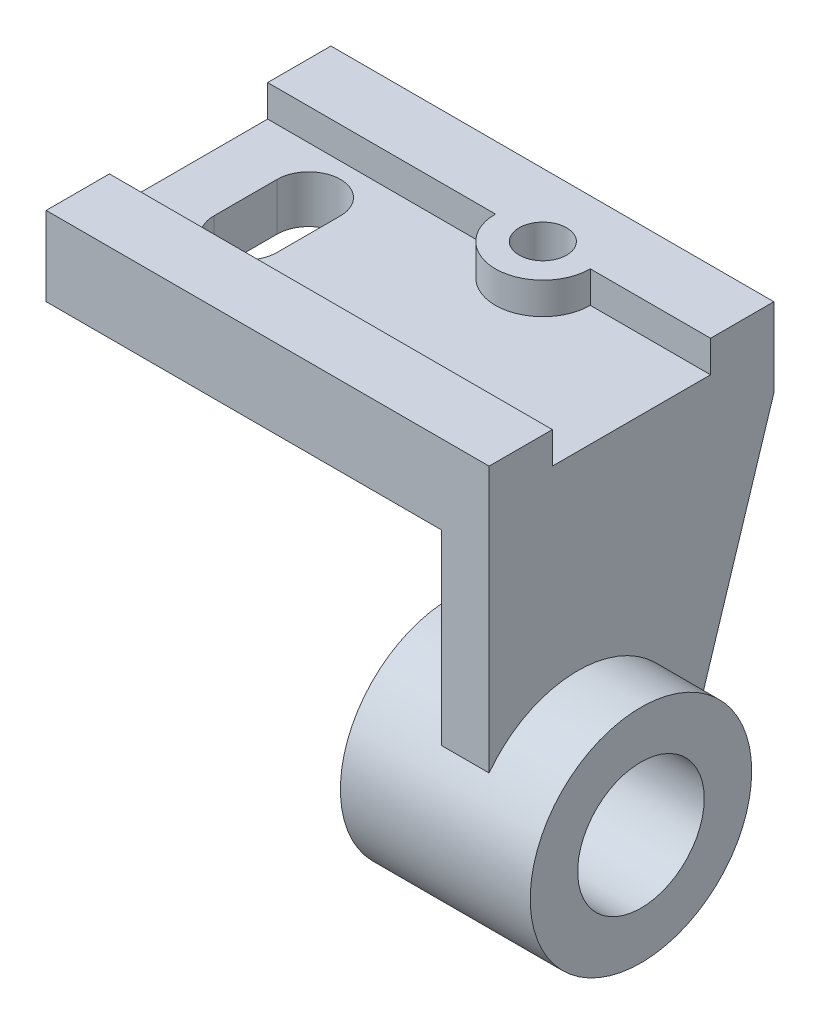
ISO-10303-21;
HEADER;
FILE_DESCRIPTION(('STEP AP214'),'2;1');
FILE_NAME('part.step','',(''),(''),'','','');
FILE_SCHEMA(('AUTOMOTIVE_DESIGN { 1 0 10303 214 1 1 1 1 }'));
ENDSEC;
DATA;
#1=APPLICATION_CONTEXT('core data for automotive mechanical design processes');
#2=APPLICATION_PROTOCOL_DEFINITION('international standard','automotive_design',2000,#1);
#3=PRODUCT_CONTEXT('',#1,'mechanical');
#4=PRODUCT('Part','Part','',(#3));
#5=PRODUCT_RELATED_PRODUCT_CATEGORY('part','',(#4));
#6=PRODUCT_DEFINITION_FORMATION('','',#4);
#7=PRODUCT_DEFINITION_CONTEXT('part definition',#1,'design');
#8=PRODUCT_DEFINITION('design','',#6,#7);
#9=PRODUCT_DEFINITION_SHAPE('','',#8);
#10=(LENGTH_UNIT() NAMED_UNIT(*) SI_UNIT(.MILLI.,.METRE.));
#11=(NAMED_UNIT(*) PLANE_ANGLE_UNIT() SI_UNIT($,.RADIAN.));
#12=(NAMED_UNIT(*) SI_UNIT($,.STERADIAN.) SOLID_ANGLE_UNIT());
#13=UNCERTAINTY_MEASURE_WITH_UNIT(LENGTH_MEASURE(1.E-05),#10,'distance_accuracy_value','');
#14=(GEOMETRIC_REPRESENTATION_CONTEXT(3) GLOBAL_UNCERTAINTY_ASSIGNED_CONTEXT((#13)) GLOBAL_UNIT_ASSIGNED_CONTEXT((#10,
#11,#12)) REPRESENTATION_CONTEXT('',''));
#15=CARTESIAN_POINT('',(0.,0.,0.));
#16=DIRECTION('',(0.,0.,1.));
#17=DIRECTION('',(1.,0.,0.));
#18=AXIS2_PLACEMENT_3D('',#15,#16,#17);
#19=CARTESIAN_POINT('',(0.,0.,0.));
#20=DIRECTION('',(0.,-1.,0.));
#21=DIRECTION('',(0.,0.,-1.));
#22=AXIS2_PLACEMENT_3D('',#19,#20,#21);
#23=PLANE('',#22);
#24=CARTESIAN_POINT('',(-53.,0.,20.));
#25=DIRECTION('',(0.,1.,0.));
#26=DIRECTION('',(0.,0.,1.));
#27=AXIS2_PLACEMENT_3D('',#24,#25,#26);
#28=CIRCLE('',#27,7.5);
#29=CARTESIAN_POINT('',(-53.,0.,27.5));
#30=VERTEX_POINT('',#29);
#31=EDGE_CURVE('E210',#30,#30,#28,.T.);
#32=ORIENTED_EDGE('',*,*,#31,.T.);
#33=EDGE_LOOP('',(#32));
#34=FACE_BOUND('',#33,.T.);
#35=CARTESIAN_POINT('',(-112.,0.,35.));
#36=DIRECTION('',(0.,1.,0.));
#37=DIRECTION('',(0.,0.,1.));
#38=AXIS2_PLACEMENT_3D('',#35,#36,#37);
#39=CIRCLE('',#38,10.);
#40=CARTESIAN_POINT('',(-102.,0.,35.));
#41=VERTEX_POINT('',#40);
#42=CARTESIAN_POINT('',(-122.,0.,35.));
#43=VERTEX_POINT('',#42);
#44=EDGE_CURVE('E180',#41,#43,#39,.T.);
#45=ORIENTED_EDGE('',*,*,#44,.T.);
#46=DIRECTION('',(0.,0.,1.));
#47=VECTOR('',#46,1.);
#48=CARTESIAN_POINT('',(-122.,0.,35.));
#49=LINE('',#48,#47);
#50=CARTESIAN_POINT('',(-122.,0.,55.));
#51=VERTEX_POINT('',#50);
#52=EDGE_CURVE('E183',#43,#51,#49,.T.);
#53=ORIENTED_EDGE('',*,*,#52,.T.);
#54=CARTESIAN_POINT('',(-112.,0.,55.));
#55=DIRECTION('',(0.,1.,0.));
#56=DIRECTION('',(0.,0.,1.));
#57=AXIS2_PLACEMENT_3D('',#54,#55,#56);
#58=CIRCLE('',#57,10.);
#59=CARTESIAN_POINT('',(-102.,0.,55.));
#60=VERTEX_POINT('',#59);
#61=EDGE_CURVE('E56',#51,#60,#58,.T.);
#62=ORIENTED_EDGE('',*,*,#61,.T.);
#63=DIRECTION('',(0.,0.,-1.));
#64=VECTOR('',#63,1.);
#65=CARTESIAN_POINT('',(-102.,0.,55.));
#66=LINE('',#65,#64);
#67=EDGE_CURVE('E188',#60,#41,#66,.T.);
#68=ORIENTED_EDGE('',*,*,#67,.T.);
#69=EDGE_LOOP('',(#45,#53,#62,#68));
#70=FACE_BOUND('',#69,.T.);
#71=DIRECTION('',(-1.,0.,0.));
#72=VECTOR('',#71,1.);
#73=CARTESIAN_POINT('',(0.,0.,0.));
#74=LINE('',#73,#72);
#75=CARTESIAN_POINT('',(-15.,0.,0.));
#76=VERTEX_POINT('',#75);
#77=CARTESIAN_POINT('',(-140.,0.,0.));
#78=VERTEX_POINT('',#77);
#79=EDGE_CURVE('E247',#76,#78,#74,.T.);
#80=ORIENTED_EDGE('',*,*,#79,.F.);
#81=DIRECTION('',(0.,0.,1.));
#82=VECTOR('',#81,1.);
#83=CARTESIAN_POINT('',(-15.,0.,0.));
#84=LINE('',#83,#82);
#85=CARTESIAN_POINT('',(-15.,0.,90.));
#86=VERTEX_POINT('',#85);
#87=EDGE_CURVE('E152',#76,#86,#84,.T.);
#88=ORIENTED_EDGE('',*,*,#87,.T.);
#89=DIRECTION('',(1.,0.,0.));
#90=VECTOR('',#89,1.);
#91=CARTESIAN_POINT('',(0.,0.,90.));
#92=LINE('',#91,#90);
#93=CARTESIAN_POINT('',(-140.,0.,90.));
#94=VERTEX_POINT('',#93);
#95=EDGE_CURVE('E288',#94,#86,#92,.T.);
#96=ORIENTED_EDGE('',*,*,#95,.F.);
#97=DIRECTION('',(0.,0.,1.));
#98=VECTOR('',#97,1.);
#99=CARTESIAN_POINT('',(-140.,0.,0.));
#100=LINE('',#99,#98);
#101=EDGE_CURVE('E273',#78,#94,#100,.T.);
#102=ORIENTED_EDGE('',*,*,#101,.F.);
#103=EDGE_LOOP('',(#80,#88,#96,#102));
#104=FACE_BOUND('',#103,.T.);
#105=ADVANCED_FACE('F31',(#34,#70,#104),#23,.T.);
#106=CARTESIAN_POINT('',(0.,25.,0.));
#107=DIRECTION('',(0.,-1.,0.));
#108=DIRECTION('',(0.,0.,-1.));
#109=AXIS2_PLACEMENT_3D('',#106,#107,#108);
#110=PLANE('',#109);
#111=CARTESIAN_POINT('',(-53.,25.,20.));
#112=DIRECTION('',(0.,1.,0.));
#113=DIRECTION('',(0.,0.,1.));
#114=AXIS2_PLACEMENT_3D('',#111,#112,#113);
#115=CIRCLE('',#114,7.5);
#116=CARTESIAN_POINT('',(-53.,25.,27.5));
#117=VERTEX_POINT('',#116);
#118=EDGE_CURVE('E203',#117,#117,#115,.T.);
#119=ORIENTED_EDGE('',*,*,#118,.F.);
#120=EDGE_LOOP('',(#119));
#121=FACE_BOUND('',#120,.T.);
#122=DIRECTION('',(0.,0.,1.));
#123=VECTOR('',#122,1.);
#124=CARTESIAN_POINT('',(-140.,25.,0.));
#125=LINE('',#124,#123);
#126=CARTESIAN_POINT('',(-140.,25.,0.));
#127=VERTEX_POINT('',#126);
#128=CARTESIAN_POINT('',(-140.,25.,20.));
#129=VERTEX_POINT('',#128);
#130=EDGE_CURVE('E265',#127,#129,#125,.T.);
#131=ORIENTED_EDGE('',*,*,#130,.T.);
#132=DIRECTION('',(-1.,0.,0.));
#133=VECTOR('',#132,1.);
#134=CARTESIAN_POINT('',(-140.,25.,20.));
#135=LINE('',#134,#133);
#136=CARTESIAN_POINT('',(-68.,25.,20.));
#137=VERTEX_POINT('',#136);
#138=EDGE_CURVE('E220',#137,#129,#135,.T.);
#139=ORIENTED_EDGE('',*,*,#138,.F.);
#140=CARTESIAN_POINT('',(-53.,25.,20.));
#141=DIRECTION('',(0.,-1.,0.));
#142=DIRECTION('',(0.,0.,1.));
#143=AXIS2_PLACEMENT_3D('',#140,#141,#142);
#144=CIRCLE('',#143,15.);
#145=CARTESIAN_POINT('',(-38.,25.,20.));
#146=VERTEX_POINT('',#145);
#147=EDGE_CURVE('E240',#146,#137,#144,.T.);
#148=ORIENTED_EDGE('',*,*,#147,.F.);
#149=DIRECTION('',(-1.,0.,0.));
#150=VECTOR('',#149,1.);
#151=CARTESIAN_POINT('',(-38.,25.,20.));
#152=LINE('',#151,#150);
#153=CARTESIAN_POINT('',(0.,25.,20.));
#154=VERTEX_POINT('',#153);
#155=EDGE_CURVE('E237',#154,#146,#152,.T.);
#156=ORIENTED_EDGE('',*,*,#155,.F.);
#157=DIRECTION('',(0.,0.,-1.));
#158=VECTOR('',#157,1.);
#159=CARTESIAN_POINT('',(0.,25.,0.));
#160=LINE('',#159,#158);
#161=CARTESIAN_POINT('',(0.,25.,0.));
#162=VERTEX_POINT('',#161);
#163=EDGE_CURVE('E262',#154,#162,#160,.T.);
#164=ORIENTED_EDGE('',*,*,#163,.T.);
#165=DIRECTION('',(-1.,0.,0.));
#166=VECTOR('',#165,1.);
#167=CARTESIAN_POINT('',(0.,25.,0.));
#168=LINE('',#167,#166);
#169=EDGE_CURVE('E261',#162,#127,#168,.T.);
#170=ORIENTED_EDGE('',*,*,#169,.T.);
#171=EDGE_LOOP('',(#131,#139,#148,#156,#164,#170));
#172=FACE_BOUND('',#171,.T.);
#173=ADVANCED_FACE('F329',(#121,#172),#110,.F.);
#174=CARTESIAN_POINT('',(0.,25.,0.));
#175=DIRECTION('',(-1.,0.,0.));
#176=DIRECTION('',(0.,0.,1.));
#177=AXIS2_PLACEMENT_3D('',#174,#175,#176);
#178=PLANE('',#177);
#179=ORIENTED_EDGE('',*,*,#163,.F.);
#180=DIRECTION('',(0.,1.,0.));
#181=VECTOR('',#180,1.);
#182=CARTESIAN_POINT('',(0.,15.,20.));
#183=LINE('',#182,#181);
#184=CARTESIAN_POINT('',(0.,15.,20.));
#185=VERTEX_POINT('',#184);
#186=EDGE_CURVE('E252',#185,#154,#183,.T.);
#187=ORIENTED_EDGE('',*,*,#186,.F.);
#188=DIRECTION('',(0.,0.,-1.));
#189=VECTOR('',#188,1.);
#190=CARTESIAN_POINT('',(0.,15.,20.));
#191=LINE('',#190,#189);
#192=CARTESIAN_POINT('',(0.,15.,70.));
#193=VERTEX_POINT('',#192);
#194=EDGE_CURVE('E223',#193,#185,#191,.T.);
#195=ORIENTED_EDGE('',*,*,#194,.F.);
#196=DIRECTION('',(0.,1.,0.));
#197=VECTOR('',#196,1.);
#198=CARTESIAN_POINT('',(0.,15.,70.));
#199=LINE('',#198,#197);
#200=CARTESIAN_POINT('',(0.,25.,70.));
#201=VERTEX_POINT('',#200);
#202=EDGE_CURVE('E254',#193,#201,#199,.T.);
#203=ORIENTED_EDGE('',*,*,#202,.T.);
#204=CARTESIAN_POINT('',(0.,25.,90.));
#205=VERTEX_POINT('',#204);
#206=EDGE_CURVE('E258',#205,#201,#160,.T.);
#207=ORIENTED_EDGE('',*,*,#206,.F.);
#208=DIRECTION('',(0.,-1.,0.));
#209=VECTOR('',#208,1.);
#210=CARTESIAN_POINT('',(0.,25.,90.));
#211=LINE('',#210,#209);
#212=CARTESIAN_POINT('',(0.,-59.,90.));
#213=VERTEX_POINT('',#212);
#214=EDGE_CURVE('E270',#205,#213,#211,.T.);
#215=ORIENTED_EDGE('',*,*,#214,.T.);
#216=CARTESIAN_POINT('',(0.,-80.,62.));
#217=DIRECTION('',(-1.,0.,0.));
#218=DIRECTION('',(0.,0.,1.));
#219=AXIS2_PLACEMENT_3D('',#216,#217,#218);
#220=CIRCLE('',#219,35.);
#221=CARTESIAN_POINT('',(0.,-90.55070893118,28.6281175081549));
#222=VERTEX_POINT('',#221);
#223=EDGE_CURVE('E175',#213,#222,#220,.T.);
#224=ORIENTED_EDGE('',*,*,#223,.T.);
#225=DIRECTION('',(0.,0.953482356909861,-0.301448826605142));
#226=VECTOR('',#225,1.);
#227=CARTESIAN_POINT('',(0.,0.,0.));
#228=LINE('',#227,#226);
#229=CARTESIAN_POINT('',(0.,0.,0.));
#230=VERTEX_POINT('',#229);
#231=EDGE_CURVE('E161',#222,#230,#228,.T.);
#232=ORIENTED_EDGE('',*,*,#231,.T.);
#233=DIRECTION('',(0.,-1.,0.));
#234=VECTOR('',#233,1.);
#235=CARTESIAN_POINT('',(0.,25.,0.));
#236=LINE('',#235,#234);
#237=EDGE_CURVE('E11',#162,#230,#236,.T.);
#238=ORIENTED_EDGE('',*,*,#237,.F.);
#239=EDGE_LOOP('',(#179,#187,#195,#203,#207,#215,#224,#232,#238));
#240=FACE_BOUND('',#239,.T.);
#241=ADVANCED_FACE('F33',(#240),#178,.F.);
#242=CARTESIAN_POINT('',(0.,25.,0.));
#243=DIRECTION('',(0.,0.,1.));
#244=DIRECTION('',(1.,0.,0.));
#245=AXIS2_PLACEMENT_3D('',#242,#243,#244);
#246=PLANE('',#245);
#247=EDGE_CURVE('E279',#230,#76,#74,.T.);
#248=ORIENTED_EDGE('',*,*,#247,.T.);
#249=ORIENTED_EDGE('',*,*,#79,.T.);
#250=DIRECTION('',(0.,-1.,0.));
#251=VECTOR('',#250,1.);
#252=CARTESIAN_POINT('',(-140.,25.,0.));
#253=LINE('',#252,#251);
#254=EDGE_CURVE('E40',#127,#78,#253,.T.);
#255=ORIENTED_EDGE('',*,*,#254,.F.);
#256=ORIENTED_EDGE('',*,*,#169,.F.);
#257=ORIENTED_EDGE('',*,*,#237,.T.);
#258=EDGE_LOOP('',(#248,#249,#255,#256,#257));
#259=FACE_BOUND('',#258,.T.);
#260=ADVANCED_FACE('F307',(#259),#246,.F.);
#261=CARTESIAN_POINT('',(-140.,25.,0.));
#262=DIRECTION('',(1.,0.,0.));
#263=DIRECTION('',(0.,0.,-1.));
#264=AXIS2_PLACEMENT_3D('',#261,#262,#263);
#265=PLANE('',#264);
#266=DIRECTION('',(0.,0.,1.));
#267=VECTOR('',#266,1.);
#268=CARTESIAN_POINT('',(-140.,15.,70.));
#269=LINE('',#268,#267);
#270=CARTESIAN_POINT('',(-140.,15.,20.));
#271=VERTEX_POINT('',#270);
#272=CARTESIAN_POINT('',(-140.,15.,70.));
#273=VERTEX_POINT('',#272);
#274=EDGE_CURVE('E216',#271,#273,#269,.T.);
#275=ORIENTED_EDGE('',*,*,#274,.F.);
#276=DIRECTION('',(0.,1.,0.));
#277=VECTOR('',#276,1.);
#278=CARTESIAN_POINT('',(-140.,15.,20.));
#279=LINE('',#278,#277);
#280=EDGE_CURVE('E244',#271,#129,#279,.T.);
#281=ORIENTED_EDGE('',*,*,#280,.T.);
#282=ORIENTED_EDGE('',*,*,#130,.F.);
#283=ORIENTED_EDGE('',*,*,#254,.T.);
#284=ORIENTED_EDGE('',*,*,#101,.T.);
#285=DIRECTION('',(0.,-1.,0.));
#286=VECTOR('',#285,1.);
#287=CARTESIAN_POINT('',(-140.,25.,90.));
#288=LINE('',#287,#286);
#289=CARTESIAN_POINT('',(-140.,25.,90.));
#290=VERTEX_POINT('',#289);
#291=EDGE_CURVE('E294',#290,#94,#288,.T.);
#292=ORIENTED_EDGE('',*,*,#291,.F.);
#293=CARTESIAN_POINT('',(-140.,25.,70.));
#294=VERTEX_POINT('',#293);
#295=EDGE_CURVE('E264',#294,#290,#125,.T.);
#296=ORIENTED_EDGE('',*,*,#295,.F.);
#297=DIRECTION('',(0.,1.,0.));
#298=VECTOR('',#297,1.);
#299=CARTESIAN_POINT('',(-140.,15.,70.));
#300=LINE('',#299,#298);
#301=EDGE_CURVE('E235',#273,#294,#300,.T.);
#302=ORIENTED_EDGE('',*,*,#301,.F.);
#303=EDGE_LOOP('',(#275,#281,#282,#283,#284,#292,#296,#302));
#304=FACE_BOUND('',#303,.T.);
#305=ADVANCED_FACE('F304',(#304),#265,.F.);
#306=CARTESIAN_POINT('',(0.,25.,90.));
#307=DIRECTION('',(0.,0.,-1.));
#308=DIRECTION('',(-1.,0.,0.));
#309=AXIS2_PLACEMENT_3D('',#306,#307,#308);
#310=PLANE('',#309);
#311=ORIENTED_EDGE('',*,*,#95,.T.);
#312=DIRECTION('',(0.,-1.,0.));
#313=VECTOR('',#312,1.);
#314=CARTESIAN_POINT('',(-15.,0.,90.));
#315=LINE('',#314,#313);
#316=CARTESIAN_POINT('',(-15.,-59.,90.));
#317=VERTEX_POINT('',#316);
#318=EDGE_CURVE('E48',#86,#317,#315,.T.);
#319=ORIENTED_EDGE('',*,*,#318,.T.);
#320=DIRECTION('',(1.,0.,0.));
#321=VECTOR('',#320,1.);
#322=CARTESIAN_POINT('',(-15.,-59.,90.));
#323=LINE('',#322,#321);
#324=EDGE_CURVE('E155',#317,#213,#323,.T.);
#325=ORIENTED_EDGE('',*,*,#324,.T.);
#326=ORIENTED_EDGE('',*,*,#214,.F.);
#327=DIRECTION('',(1.,0.,0.));
#328=VECTOR('',#327,1.);
#329=CARTESIAN_POINT('',(0.,25.,90.));
#330=LINE('',#329,#328);
#331=EDGE_CURVE('E268',#290,#205,#330,.T.);
#332=ORIENTED_EDGE('',*,*,#331,.F.);
#333=ORIENTED_EDGE('',*,*,#291,.T.);
#334=EDGE_LOOP('',(#311,#319,#325,#326,#332,#333));
#335=FACE_BOUND('',#334,.T.);
#336=ADVANCED_FACE('F291',(#335),#310,.F.);
#337=ORIENTED_EDGE('',*,*,#206,.T.);
#338=DIRECTION('',(1.,0.,0.));
#339=VECTOR('',#338,1.);
#340=CARTESIAN_POINT('',(0.,25.,70.));
#341=LINE('',#340,#339);
#342=EDGE_CURVE('E213',#294,#201,#341,.T.);
#343=ORIENTED_EDGE('',*,*,#342,.F.);
#344=ORIENTED_EDGE('',*,*,#295,.T.);
#345=ORIENTED_EDGE('',*,*,#331,.T.);
#346=EDGE_LOOP('',(#337,#343,#344,#345));
#347=FACE_BOUND('',#346,.T.);
#348=ADVANCED_FACE('F314',(#347),#110,.F.);
#349=CARTESIAN_POINT('',(-140.,15.,20.));
#350=DIRECTION('',(0.,0.,-1.));
#351=DIRECTION('',(-1.,0.,0.));
#352=AXIS2_PLACEMENT_3D('',#349,#350,#351);
#353=PLANE('',#352);
#354=ORIENTED_EDGE('',*,*,#138,.T.);
#355=ORIENTED_EDGE('',*,*,#280,.F.);
#356=DIRECTION('',(-1.,0.,0.));
#357=VECTOR('',#356,1.);
#358=CARTESIAN_POINT('',(-140.,15.,20.));
#359=LINE('',#358,#357);
#360=CARTESIAN_POINT('',(-68.,15.,20.));
#361=VERTEX_POINT('',#360);
#362=EDGE_CURVE('E232',#361,#271,#359,.T.);
#363=ORIENTED_EDGE('',*,*,#362,.F.);
#364=DIRECTION('',(0.,1.,0.));
#365=VECTOR('',#364,1.);
#366=CARTESIAN_POINT('',(-68.,15.,20.));
#367=LINE('',#366,#365);
#368=EDGE_CURVE('E248',#361,#137,#367,.T.);
#369=ORIENTED_EDGE('',*,*,#368,.T.);
#370=EDGE_LOOP('',(#354,#355,#363,#369));
#371=FACE_BOUND('',#370,.T.);
#372=ADVANCED_FACE('F326',(#371),#353,.F.);
#373=CARTESIAN_POINT('',(-53.,15.,20.));
#374=DIRECTION('',(0.,1.,0.));
#375=DIRECTION('',(0.,0.,1.));
#376=AXIS2_PLACEMENT_3D('',#373,#374,#375);
#377=CYLINDRICAL_SURFACE('',#376,15.);
#378=ORIENTED_EDGE('',*,*,#147,.T.);
#379=ORIENTED_EDGE('',*,*,#368,.F.);
#380=CARTESIAN_POINT('',(-53.,15.,20.));
#381=DIRECTION('',(0.,-1.,0.));
#382=DIRECTION('',(0.,0.,1.));
#383=AXIS2_PLACEMENT_3D('',#380,#381,#382);
#384=CIRCLE('',#383,15.);
#385=CARTESIAN_POINT('',(-38.,15.,20.));
#386=VERTEX_POINT('',#385);
#387=EDGE_CURVE('E229',#386,#361,#384,.T.);
#388=ORIENTED_EDGE('',*,*,#387,.F.);
#389=DIRECTION('',(0.,1.,0.));
#390=VECTOR('',#389,1.);
#391=CARTESIAN_POINT('',(-38.,15.,20.));
#392=LINE('',#391,#390);
#393=EDGE_CURVE('E250',#386,#146,#392,.T.);
#394=ORIENTED_EDGE('',*,*,#393,.T.);
#395=EDGE_LOOP('',(#378,#379,#388,#394));
#396=FACE_BOUND('',#395,.T.);
#397=ADVANCED_FACE('F336',(#396),#377,.T.);
#398=CARTESIAN_POINT('',(-38.,15.,20.));
#399=DIRECTION('',(0.,0.,-1.));
#400=DIRECTION('',(-1.,0.,0.));
#401=AXIS2_PLACEMENT_3D('',#398,#399,#400);
#402=PLANE('',#401);
#403=ORIENTED_EDGE('',*,*,#155,.T.);
#404=ORIENTED_EDGE('',*,*,#393,.F.);
#405=DIRECTION('',(-1.,0.,0.));
#406=VECTOR('',#405,1.);
#407=CARTESIAN_POINT('',(-38.,15.,20.));
#408=LINE('',#407,#406);
#409=EDGE_CURVE('E226',#185,#386,#408,.T.);
#410=ORIENTED_EDGE('',*,*,#409,.F.);
#411=ORIENTED_EDGE('',*,*,#186,.T.);
#412=EDGE_LOOP('',(#403,#404,#410,#411));
#413=FACE_BOUND('',#412,.T.);
#414=ADVANCED_FACE('F334',(#413),#402,.F.);
#415=CARTESIAN_POINT('',(0.,15.,70.));
#416=DIRECTION('',(0.,0.,1.));
#417=DIRECTION('',(1.,0.,0.));
#418=AXIS2_PLACEMENT_3D('',#415,#416,#417);
#419=PLANE('',#418);
#420=ORIENTED_EDGE('',*,*,#342,.T.);
#421=ORIENTED_EDGE('',*,*,#202,.F.);
#422=DIRECTION('',(1.,0.,0.));
#423=VECTOR('',#422,1.);
#424=CARTESIAN_POINT('',(0.,15.,70.));
#425=LINE('',#424,#423);
#426=EDGE_CURVE('E219',#273,#193,#425,.T.);
#427=ORIENTED_EDGE('',*,*,#426,.F.);
#428=ORIENTED_EDGE('',*,*,#301,.T.);
#429=EDGE_LOOP('',(#420,#421,#427,#428));
#430=FACE_BOUND('',#429,.T.);
#431=ADVANCED_FACE('F319',(#430),#419,.F.);
#432=CARTESIAN_POINT('',(-53.,15.,20.));
#433=DIRECTION('',(0.,1.,0.));
#434=DIRECTION('',(0.,0.,1.));
#435=AXIS2_PLACEMENT_3D('',#432,#433,#434);
#436=PLANE('',#435);
#437=CARTESIAN_POINT('',(-112.,15.,35.));
#438=DIRECTION('',(0.,1.,0.));
#439=DIRECTION('',(0.,0.,1.));
#440=AXIS2_PLACEMENT_3D('',#437,#438,#439);
#441=CIRCLE('',#440,10.);
#442=CARTESIAN_POINT('',(-102.,15.,35.));
#443=VERTEX_POINT('',#442);
#444=CARTESIAN_POINT('',(-122.,15.,35.));
#445=VERTEX_POINT('',#444);
#446=EDGE_CURVE('E164',#443,#445,#441,.T.);
#447=ORIENTED_EDGE('',*,*,#446,.F.);
#448=DIRECTION('',(0.,0.,-1.));
#449=VECTOR('',#448,1.);
#450=CARTESIAN_POINT('',(-102.,15.,55.));
#451=LINE('',#450,#449);
#452=CARTESIAN_POINT('',(-102.,15.,55.));
#453=VERTEX_POINT('',#452);
#454=EDGE_CURVE('E184',#453,#443,#451,.T.);
#455=ORIENTED_EDGE('',*,*,#454,.F.);
#456=CARTESIAN_POINT('',(-112.,15.,55.));
#457=DIRECTION('',(0.,1.,0.));
#458=DIRECTION('',(0.,0.,1.));
#459=AXIS2_PLACEMENT_3D('',#456,#457,#458);
#460=CIRCLE('',#459,10.);
#461=CARTESIAN_POINT('',(-122.,15.,55.));
#462=VERTEX_POINT('',#461);
#463=EDGE_CURVE('E196',#462,#453,#460,.T.);
#464=ORIENTED_EDGE('',*,*,#463,.F.);
#465=DIRECTION('',(0.,0.,1.));
#466=VECTOR('',#465,1.);
#467=CARTESIAN_POINT('',(-122.,15.,35.));
#468=LINE('',#467,#466);
#469=EDGE_CURVE('E193',#445,#462,#468,.T.);
#470=ORIENTED_EDGE('',*,*,#469,.F.);
#471=EDGE_LOOP('',(#447,#455,#464,#470));
#472=FACE_BOUND('',#471,.T.);
#473=ORIENTED_EDGE('',*,*,#274,.T.);
#474=ORIENTED_EDGE('',*,*,#426,.T.);
#475=ORIENTED_EDGE('',*,*,#194,.T.);
#476=ORIENTED_EDGE('',*,*,#409,.T.);
#477=ORIENTED_EDGE('',*,*,#387,.T.);
#478=ORIENTED_EDGE('',*,*,#362,.T.);
#479=EDGE_LOOP('',(#473,#474,#475,#476,#477,#478));
#480=FACE_BOUND('',#479,.T.);
#481=ADVANCED_FACE('F322',(#472,#480),#436,.T.);
#482=CARTESIAN_POINT('',(-53.,0.,20.));
#483=DIRECTION('',(0.,1.,0.));
#484=DIRECTION('',(0.,0.,1.));
#485=AXIS2_PLACEMENT_3D('',#482,#483,#484);
#486=CYLINDRICAL_SURFACE('',#485,7.5);
#487=ORIENTED_EDGE('',*,*,#31,.F.);
#488=EDGE_LOOP('',(#487));
#489=FACE_BOUND('',#488,.T.);
#490=ORIENTED_EDGE('',*,*,#118,.T.);
#491=EDGE_LOOP('',(#490));
#492=FACE_BOUND('',#491,.T.);
#493=ADVANCED_FACE('F381',(#489,#492),#486,.F.);
#494=CARTESIAN_POINT('',(-112.,0.,35.));
#495=DIRECTION('',(0.,1.,0.));
#496=DIRECTION('',(0.,0.,1.));
#497=AXIS2_PLACEMENT_3D('',#494,#495,#496);
#498=CYLINDRICAL_SURFACE('',#497,10.);
#499=ORIENTED_EDGE('',*,*,#446,.T.);
#500=DIRECTION('',(0.,1.,0.));
#501=VECTOR('',#500,1.);
#502=CARTESIAN_POINT('',(-122.,0.,35.));
#503=LINE('',#502,#501);
#504=EDGE_CURVE('E191',#43,#445,#503,.T.);
#505=ORIENTED_EDGE('',*,*,#504,.F.);
#506=ORIENTED_EDGE('',*,*,#44,.F.);
#507=DIRECTION('',(0.,1.,0.));
#508=VECTOR('',#507,1.);
#509=CARTESIAN_POINT('',(-102.,0.,35.));
#510=LINE('',#509,#508);
#511=EDGE_CURVE('E201',#41,#443,#510,.T.);
#512=ORIENTED_EDGE('',*,*,#511,.T.);
#513=EDGE_LOOP('',(#499,#505,#506,#512));
#514=FACE_BOUND('',#513,.T.);
#515=ADVANCED_FACE('F386',(#514),#498,.F.);
#516=CARTESIAN_POINT('',(-102.,0.,55.));
#517=DIRECTION('',(1.,0.,0.));
#518=DIRECTION('',(0.,0.,-1.));
#519=AXIS2_PLACEMENT_3D('',#516,#517,#518);
#520=PLANE('',#519);
#521=ORIENTED_EDGE('',*,*,#454,.T.);
#522=ORIENTED_EDGE('',*,*,#511,.F.);
#523=ORIENTED_EDGE('',*,*,#67,.F.);
#524=DIRECTION('',(0.,1.,0.));
#525=VECTOR('',#524,1.);
#526=CARTESIAN_POINT('',(-102.,0.,55.));
#527=LINE('',#526,#525);
#528=EDGE_CURVE('E204',#60,#453,#527,.T.);
#529=ORIENTED_EDGE('',*,*,#528,.T.);
#530=EDGE_LOOP('',(#521,#522,#523,#529));
#531=FACE_BOUND('',#530,.T.);
#532=ADVANCED_FACE('F405',(#531),#520,.F.);
#533=CARTESIAN_POINT('',(-112.,0.,55.));
#534=DIRECTION('',(0.,1.,0.));
#535=DIRECTION('',(0.,0.,1.));
#536=AXIS2_PLACEMENT_3D('',#533,#534,#535);
#537=CYLINDRICAL_SURFACE('',#536,10.);
#538=ORIENTED_EDGE('',*,*,#463,.T.);
#539=ORIENTED_EDGE('',*,*,#528,.F.);
#540=ORIENTED_EDGE('',*,*,#61,.F.);
#541=DIRECTION('',(0.,1.,0.));
#542=VECTOR('',#541,1.);
#543=CARTESIAN_POINT('',(-122.,0.,55.));
#544=LINE('',#543,#542);
#545=EDGE_CURVE('E206',#51,#462,#544,.T.);
#546=ORIENTED_EDGE('',*,*,#545,.T.);
#547=EDGE_LOOP('',(#538,#539,#540,#546));
#548=FACE_BOUND('',#547,.T.);
#549=ADVANCED_FACE('F415',(#548),#537,.F.);
#550=CARTESIAN_POINT('',(-122.,0.,35.));
#551=DIRECTION('',(-1.,0.,0.));
#552=DIRECTION('',(0.,0.,1.));
#553=AXIS2_PLACEMENT_3D('',#550,#551,#552);
#554=PLANE('',#553);
#555=ORIENTED_EDGE('',*,*,#469,.T.);
#556=ORIENTED_EDGE('',*,*,#545,.F.);
#557=ORIENTED_EDGE('',*,*,#52,.F.);
#558=ORIENTED_EDGE('',*,*,#504,.T.);
#559=EDGE_LOOP('',(#555,#556,#557,#558));
#560=FACE_BOUND('',#559,.T.);
#561=ADVANCED_FACE('F425',(#560),#554,.F.);
#562=CARTESIAN_POINT('',(-15.,0.,0.));
#563=DIRECTION('',(0.,-0.301448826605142,-0.953482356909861));
#564=DIRECTION('',(0.,0.953482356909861,-0.301448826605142));
#565=AXIS2_PLACEMENT_3D('',#562,#563,#564);
#566=PLANE('',#565);
#567=ORIENTED_EDGE('',*,*,#231,.F.);
#568=DIRECTION('',(1.,0.,0.));
#569=VECTOR('',#568,1.);
#570=CARTESIAN_POINT('',(-15.,-90.55070893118,28.6281175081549));
#571=LINE('',#570,#569);
#572=CARTESIAN_POINT('',(-15.,-90.55070893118,28.6281175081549));
#573=VERTEX_POINT('',#572);
#574=EDGE_CURVE('E158',#573,#222,#571,.T.);
#575=ORIENTED_EDGE('',*,*,#574,.F.);
#576=DIRECTION('',(0.,0.953482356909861,-0.301448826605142));
#577=VECTOR('',#576,1.);
#578=CARTESIAN_POINT('',(-15.,0.,0.));
#579=LINE('',#578,#577);
#580=EDGE_CURVE('E147',#573,#76,#579,.T.);
#581=ORIENTED_EDGE('',*,*,#580,.T.);
#582=ORIENTED_EDGE('',*,*,#247,.F.);
#583=EDGE_LOOP('',(#567,#575,#581,#582));
#584=FACE_BOUND('',#583,.T.);
#585=ADVANCED_FACE('F159',(#584),#566,.T.);
#586=CARTESIAN_POINT('',(-15.,-80.,62.));
#587=DIRECTION('',(-1.,0.,0.));
#588=DIRECTION('',(0.,0.,1.));
#589=AXIS2_PLACEMENT_3D('',#586,#587,#588);
#590=PLANE('',#589);
#591=ORIENTED_EDGE('',*,*,#87,.F.);
#592=ORIENTED_EDGE('',*,*,#580,.F.);
#593=CARTESIAN_POINT('',(-15.,-80.,62.));
#594=DIRECTION('',(-1.,0.,0.));
#595=DIRECTION('',(0.,0.,1.));
#596=AXIS2_PLACEMENT_3D('',#593,#594,#595);
#597=CIRCLE('',#596,35.);
#598=EDGE_CURVE('E151',#317,#573,#597,.T.);
#599=ORIENTED_EDGE('',*,*,#598,.F.);
#600=ORIENTED_EDGE('',*,*,#318,.F.);
#601=EDGE_LOOP('',(#591,#592,#599,#600));
#602=FACE_BOUND('',#601,.T.);
#603=ADVANCED_FACE('F149',(#602),#590,.T.);
#604=CARTESIAN_POINT('',(20.,-80.,62.));
#605=DIRECTION('',(-1.,0.,0.));
#606=DIRECTION('',(0.,0.,1.));
#607=AXIS2_PLACEMENT_3D('',#604,#605,#606);
#608=CYLINDRICAL_SURFACE('',#607,35.);
#609=CARTESIAN_POINT('',(-40.,-80.,62.));
#610=DIRECTION('',(1.,0.,0.));
#611=DIRECTION('',(0.,0.,-1.));
#612=AXIS2_PLACEMENT_3D('',#609,#610,#611);
#613=CIRCLE('',#612,35.);
#614=CARTESIAN_POINT('',(-40.,-80.,27.));
#615=VERTEX_POINT('',#614);
#616=EDGE_CURVE('E553',#615,#615,#613,.T.);
#617=ORIENTED_EDGE('',*,*,#616,.T.);
#618=EDGE_LOOP('',(#617));
#619=FACE_BOUND('',#618,.T.);
#620=CARTESIAN_POINT('',(20.,-80.,62.));
#621=DIRECTION('',(1.,0.,0.));
#622=DIRECTION('',(0.,0.,-1.));
#623=AXIS2_PLACEMENT_3D('',#620,#621,#622);
#624=CIRCLE('',#623,35.);
#625=CARTESIAN_POINT('',(20.,-80.,27.));
#626=VERTEX_POINT('',#625);
#627=EDGE_CURVE('E177',#626,#626,#624,.T.);
#628=ORIENTED_EDGE('',*,*,#627,.F.);
#629=EDGE_LOOP('',(#628));
#630=FACE_BOUND('',#629,.T.);
#631=ORIENTED_EDGE('',*,*,#574,.T.);
#632=ORIENTED_EDGE('',*,*,#223,.F.);
#633=ORIENTED_EDGE('',*,*,#324,.F.);
#634=ORIENTED_EDGE('',*,*,#598,.T.);
#635=EDGE_LOOP('',(#631,#632,#633,#634));
#636=FACE_BOUND('',#635,.T.);
#637=ADVANCED_FACE('F167',(#619,#630,#636),#608,.T.);
#638=CARTESIAN_POINT('',(20.,-80.,62.));
#639=DIRECTION('',(1.,0.,0.));
#640=DIRECTION('',(0.,0.,-1.));
#641=AXIS2_PLACEMENT_3D('',#638,#639,#640);
#642=PLANE('',#641);
#643=ORIENTED_EDGE('',*,*,#627,.T.);
#644=EDGE_LOOP('',(#643));
#645=FACE_BOUND('',#644,.T.);
#646=CARTESIAN_POINT('',(20.,-80.,62.));
#647=DIRECTION('',(1.,0.,0.));
#648=DIRECTION('',(0.,0.,-1.));
#649=AXIS2_PLACEMENT_3D('',#646,#647,#648);
#650=CIRCLE('',#649,20.);
#651=CARTESIAN_POINT('',(20.,-80.,42.));
#652=VERTEX_POINT('',#651);
#653=EDGE_CURVE('E547',#652,#652,#650,.T.);
#654=ORIENTED_EDGE('',*,*,#653,.F.);
#655=EDGE_LOOP('',(#654));
#656=FACE_BOUND('',#655,.T.);
#657=ADVANCED_FACE('F449',(#645,#656),#642,.T.);
#658=CARTESIAN_POINT('',(-40.,-80.,62.));
#659=DIRECTION('',(1.,0.,0.));
#660=DIRECTION('',(0.,0.,-1.));
#661=AXIS2_PLACEMENT_3D('',#658,#659,#660);
#662=PLANE('',#661);
#663=ORIENTED_EDGE('',*,*,#616,.F.);
#664=EDGE_LOOP('',(#663));
#665=FACE_BOUND('',#664,.T.);
#666=CARTESIAN_POINT('',(-40.,-80.,62.));
#667=DIRECTION('',(1.,0.,0.));
#668=DIRECTION('',(0.,0.,-1.));
#669=AXIS2_PLACEMENT_3D('',#666,#667,#668);
#670=CIRCLE('',#669,20.);
#671=CARTESIAN_POINT('',(-40.,-80.,42.));
#672=VERTEX_POINT('',#671);
#673=EDGE_CURVE('E550',#672,#672,#670,.T.);
#674=ORIENTED_EDGE('',*,*,#673,.T.);
#675=EDGE_LOOP('',(#674));
#676=FACE_BOUND('',#675,.T.);
#677=ADVANCED_FACE('F459',(#665,#676),#662,.F.);
#678=CARTESIAN_POINT('',(20.,-80.,62.));
#679=DIRECTION('',(-1.,0.,0.));
#680=DIRECTION('',(0.,0.,1.));
#681=AXIS2_PLACEMENT_3D('',#678,#679,#680);
#682=CYLINDRICAL_SURFACE('',#681,20.);
#683=ORIENTED_EDGE('',*,*,#653,.T.);
#684=EDGE_LOOP('',(#683));
#685=FACE_BOUND('',#684,.T.);
#686=ORIENTED_EDGE('',*,*,#673,.F.);
#687=EDGE_LOOP('',(#686));
#688=FACE_BOUND('',#687,.T.);
#689=ADVANCED_FACE('F468',(#685,#688),#682,.F.);
#690=CLOSED_SHELL('',(#105,#173,#241,#260,#305,#336,#348,#372,#397,#414,#431,#481,#493,#515,
#532,#549,#561,#585,#603,#637,#657,#677,#689));
#691=MANIFOLD_SOLID_BREP('B2',#690);
#692=ADVANCED_BREP_SHAPE_REPRESENTATION('',(#18,#691),#14);
#693=SHAPE_DEFINITION_REPRESENTATION(#9,#692);
ENDSEC;
END-ISO-10303-21;
